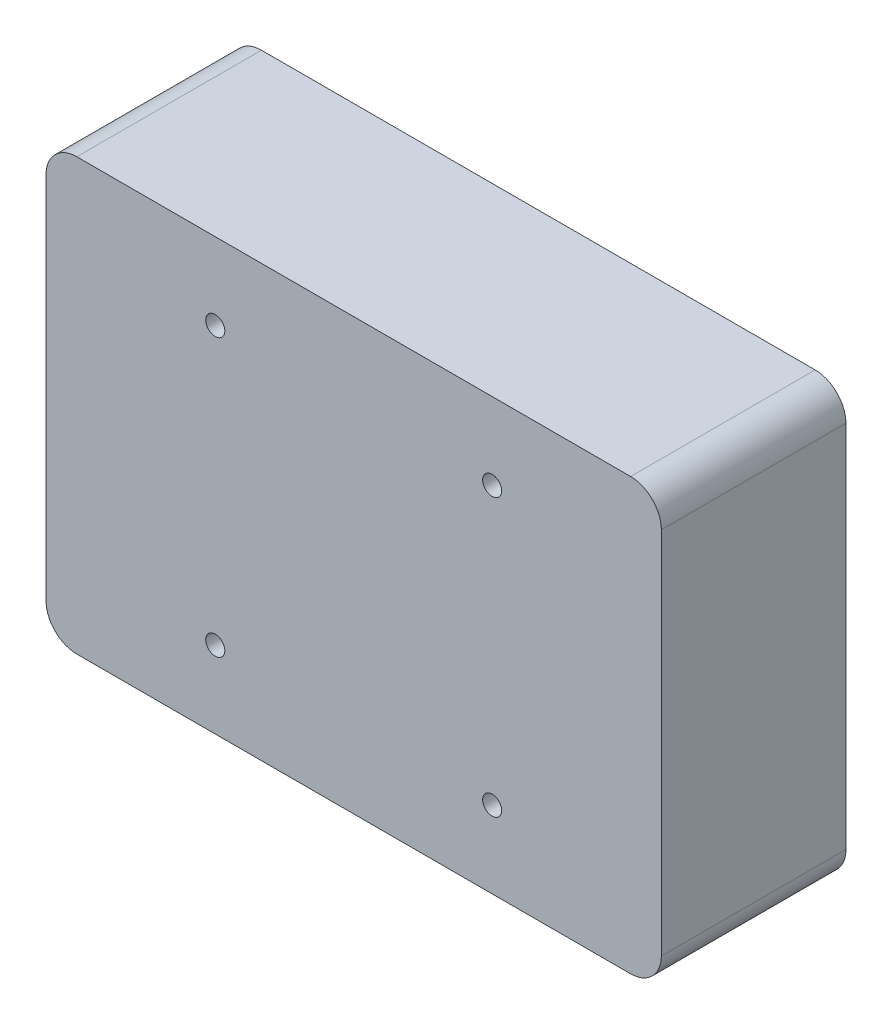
ISO-10303-21;
HEADER;
FILE_DESCRIPTION(('STEP AP214'),'2;1');
FILE_NAME('part.step','',(''),(''),'','','');
FILE_SCHEMA(('AUTOMOTIVE_DESIGN { 1 0 10303 214 1 1 1 1 }'));
ENDSEC;
DATA;
#1=APPLICATION_CONTEXT('core data for automotive mechanical design processes');
#2=APPLICATION_PROTOCOL_DEFINITION('international standard','automotive_design',2000,#1);
#3=PRODUCT_CONTEXT('',#1,'mechanical');
#4=PRODUCT('Part','Part','',(#3));
#5=PRODUCT_RELATED_PRODUCT_CATEGORY('part','',(#4));
#6=PRODUCT_DEFINITION_FORMATION('','',#4);
#7=PRODUCT_DEFINITION_CONTEXT('part definition',#1,'design');
#8=PRODUCT_DEFINITION('design','',#6,#7);
#9=PRODUCT_DEFINITION_SHAPE('','',#8);
#10=(LENGTH_UNIT() NAMED_UNIT(*) SI_UNIT(.MILLI.,.METRE.));
#11=(NAMED_UNIT(*) PLANE_ANGLE_UNIT() SI_UNIT($,.RADIAN.));
#12=(NAMED_UNIT(*) SI_UNIT($,.STERADIAN.) SOLID_ANGLE_UNIT());
#13=UNCERTAINTY_MEASURE_WITH_UNIT(LENGTH_MEASURE(1.E-05),#10,'distance_accuracy_value','');
#14=(GEOMETRIC_REPRESENTATION_CONTEXT(3) GLOBAL_UNCERTAINTY_ASSIGNED_CONTEXT((#13)) GLOBAL_UNIT_ASSIGNED_CONTEXT((#10,
#11,#12)) REPRESENTATION_CONTEXT('',''));
#15=CARTESIAN_POINT('',(0.,0.,0.));
#16=DIRECTION('',(0.,0.,1.));
#17=DIRECTION('',(1.,0.,0.));
#18=AXIS2_PLACEMENT_3D('',#15,#16,#17);
#19=CARTESIAN_POINT('',(0.,0.,30.));
#20=DIRECTION('',(0.,0.,1.));
#21=DIRECTION('',(1.,0.,0.));
#22=AXIS2_PLACEMENT_3D('',#19,#20,#21);
#23=PLANE('',#22);
#24=CARTESIAN_POINT('',(22.5,-22.5,30.));
#25=DIRECTION('',(0.,0.,1.));
#26=DIRECTION('',(1.,0.,0.));
#27=AXIS2_PLACEMENT_3D('',#24,#25,#26);
#28=CIRCLE('',#27,1.55);
#29=CARTESIAN_POINT('',(24.05,-22.5,30.));
#30=VERTEX_POINT('',#29);
#31=EDGE_CURVE('E219',#30,#30,#28,.T.);
#32=ORIENTED_EDGE('',*,*,#31,.F.);
#33=EDGE_LOOP('',(#32));
#34=FACE_BOUND('',#33,.T.);
#35=CARTESIAN_POINT('',(-22.5,22.5,30.));
#36=DIRECTION('',(0.,0.,1.));
#37=DIRECTION('',(1.,0.,0.));
#38=AXIS2_PLACEMENT_3D('',#35,#36,#37);
#39=CIRCLE('',#38,1.55);
#40=CARTESIAN_POINT('',(-20.95,22.5,30.));
#41=VERTEX_POINT('',#40);
#42=EDGE_CURVE('E144',#41,#41,#39,.T.);
#43=ORIENTED_EDGE('',*,*,#42,.F.);
#44=EDGE_LOOP('',(#43));
#45=FACE_BOUND('',#44,.T.);
#46=DIRECTION('',(0.,1.,0.));
#47=VECTOR('',#46,1.);
#48=CARTESIAN_POINT('',(50.,35.,30.));
#49=LINE('',#48,#47);
#50=CARTESIAN_POINT('',(50.,-30.,30.));
#51=VERTEX_POINT('',#50);
#52=CARTESIAN_POINT('',(50.,30.,30.));
#53=VERTEX_POINT('',#52);
#54=EDGE_CURVE('E150',#51,#53,#49,.T.);
#55=ORIENTED_EDGE('',*,*,#54,.T.);
#56=CARTESIAN_POINT('',(45.,30.,30.));
#57=DIRECTION('',(0.,0.,1.));
#58=DIRECTION('',(1.,0.,0.));
#59=AXIS2_PLACEMENT_3D('',#56,#57,#58);
#60=CIRCLE('',#59,5.);
#61=CARTESIAN_POINT('',(45.,35.,30.));
#62=VERTEX_POINT('',#61);
#63=EDGE_CURVE('E174',#53,#62,#60,.T.);
#64=ORIENTED_EDGE('',*,*,#63,.T.);
#65=DIRECTION('',(-1.,0.,0.));
#66=VECTOR('',#65,1.);
#67=CARTESIAN_POINT('',(-50.,35.,30.));
#68=LINE('',#67,#66);
#69=CARTESIAN_POINT('',(-45.,35.,30.));
#70=VERTEX_POINT('',#69);
#71=EDGE_CURVE('E127',#62,#70,#68,.T.);
#72=ORIENTED_EDGE('',*,*,#71,.T.);
#73=CARTESIAN_POINT('',(-45.,30.,30.));
#74=DIRECTION('',(0.,0.,1.));
#75=DIRECTION('',(1.,0.,0.));
#76=AXIS2_PLACEMENT_3D('',#73,#74,#75);
#77=CIRCLE('',#76,5.);
#78=CARTESIAN_POINT('',(-50.,30.,30.));
#79=VERTEX_POINT('',#78);
#80=EDGE_CURVE('E166',#70,#79,#77,.T.);
#81=ORIENTED_EDGE('',*,*,#80,.T.);
#82=DIRECTION('',(0.,-1.,0.));
#83=VECTOR('',#82,1.);
#84=CARTESIAN_POINT('',(-50.,35.,30.));
#85=LINE('',#84,#83);
#86=CARTESIAN_POINT('',(-50.,-30.,30.));
#87=VERTEX_POINT('',#86);
#88=EDGE_CURVE('E189',#79,#87,#85,.T.);
#89=ORIENTED_EDGE('',*,*,#88,.T.);
#90=CARTESIAN_POINT('',(-45.,-30.,30.));
#91=DIRECTION('',(0.,0.,1.));
#92=DIRECTION('',(1.,0.,0.));
#93=AXIS2_PLACEMENT_3D('',#90,#91,#92);
#94=CIRCLE('',#93,5.);
#95=CARTESIAN_POINT('',(-45.,-35.,30.));
#96=VERTEX_POINT('',#95);
#97=EDGE_CURVE('E62',#87,#96,#94,.T.);
#98=ORIENTED_EDGE('',*,*,#97,.T.);
#99=DIRECTION('',(1.,0.,0.));
#100=VECTOR('',#99,1.);
#101=CARTESIAN_POINT('',(-50.,-35.,30.));
#102=LINE('',#101,#100);
#103=CARTESIAN_POINT('',(45.,-35.,30.));
#104=VERTEX_POINT('',#103);
#105=EDGE_CURVE('E152',#96,#104,#102,.T.);
#106=ORIENTED_EDGE('',*,*,#105,.T.);
#107=CARTESIAN_POINT('',(45.,-30.,30.));
#108=DIRECTION('',(0.,0.,1.));
#109=DIRECTION('',(1.,0.,0.));
#110=AXIS2_PLACEMENT_3D('',#107,#108,#109);
#111=CIRCLE('',#110,5.);
#112=EDGE_CURVE('E171',#104,#51,#111,.T.);
#113=ORIENTED_EDGE('',*,*,#112,.T.);
#114=EDGE_LOOP('',(#55,#64,#72,#81,#89,#98,#106,#113));
#115=FACE_BOUND('',#114,.T.);
#116=CARTESIAN_POINT('',(-22.5,-22.5,30.));
#117=DIRECTION('',(0.,0.,1.));
#118=DIRECTION('',(1.,0.,0.));
#119=AXIS2_PLACEMENT_3D('',#116,#117,#118);
#120=CIRCLE('',#119,1.55);
#121=CARTESIAN_POINT('',(-20.95,-22.5,30.));
#122=VERTEX_POINT('',#121);
#123=EDGE_CURVE('E211',#122,#122,#120,.T.);
#124=ORIENTED_EDGE('',*,*,#123,.F.);
#125=EDGE_LOOP('',(#124));
#126=FACE_BOUND('',#125,.T.);
#127=CARTESIAN_POINT('',(22.5,22.5,30.));
#128=DIRECTION('',(0.,0.,1.));
#129=DIRECTION('',(1.,0.,0.));
#130=AXIS2_PLACEMENT_3D('',#127,#128,#129);
#131=CIRCLE('',#130,1.55);
#132=CARTESIAN_POINT('',(24.05,22.5,30.));
#133=VERTEX_POINT('',#132);
#134=EDGE_CURVE('E227',#133,#133,#131,.T.);
#135=ORIENTED_EDGE('',*,*,#134,.F.);
#136=EDGE_LOOP('',(#135));
#137=FACE_BOUND('',#136,.T.);
#138=ADVANCED_FACE('F39',(#34,#45,#115,#126,#137),#23,.T.);
#139=CARTESIAN_POINT('',(0.,0.,0.));
#140=DIRECTION('',(0.,0.,1.));
#141=DIRECTION('',(1.,0.,0.));
#142=AXIS2_PLACEMENT_3D('',#139,#140,#141);
#143=PLANE('',#142);
#144=DIRECTION('',(-1.,0.,0.));
#145=VECTOR('',#144,1.);
#146=CARTESIAN_POINT('',(-50.,35.,0.));
#147=LINE('',#146,#145);
#148=CARTESIAN_POINT('',(45.,35.,0.));
#149=VERTEX_POINT('',#148);
#150=CARTESIAN_POINT('',(-45.,35.,0.));
#151=VERTEX_POINT('',#150);
#152=EDGE_CURVE('E124',#149,#151,#147,.T.);
#153=ORIENTED_EDGE('',*,*,#152,.F.);
#154=CARTESIAN_POINT('',(45.,30.,0.));
#155=DIRECTION('',(0.,0.,1.));
#156=DIRECTION('',(1.,0.,0.));
#157=AXIS2_PLACEMENT_3D('',#154,#155,#156);
#158=CIRCLE('',#157,5.);
#159=CARTESIAN_POINT('',(50.,30.,0.));
#160=VERTEX_POINT('',#159);
#161=EDGE_CURVE('E106',#149,#160,#158,.F.);
#162=ORIENTED_EDGE('',*,*,#161,.T.);
#163=DIRECTION('',(0.,1.,0.));
#164=VECTOR('',#163,1.);
#165=CARTESIAN_POINT('',(50.,35.,0.));
#166=LINE('',#165,#164);
#167=CARTESIAN_POINT('',(50.,-30.,0.));
#168=VERTEX_POINT('',#167);
#169=EDGE_CURVE('E137',#168,#160,#166,.T.);
#170=ORIENTED_EDGE('',*,*,#169,.F.);
#171=CARTESIAN_POINT('',(45.,-30.,0.));
#172=DIRECTION('',(0.,0.,1.));
#173=DIRECTION('',(1.,0.,0.));
#174=AXIS2_PLACEMENT_3D('',#171,#172,#173);
#175=CIRCLE('',#174,5.);
#176=CARTESIAN_POINT('',(45.,-35.,0.));
#177=VERTEX_POINT('',#176);
#178=EDGE_CURVE('E118',#168,#177,#175,.F.);
#179=ORIENTED_EDGE('',*,*,#178,.T.);
#180=DIRECTION('',(1.,0.,0.));
#181=VECTOR('',#180,1.);
#182=CARTESIAN_POINT('',(-50.,-35.,0.));
#183=LINE('',#182,#181);
#184=CARTESIAN_POINT('',(-45.,-35.,0.));
#185=VERTEX_POINT('',#184);
#186=EDGE_CURVE('E142',#185,#177,#183,.T.);
#187=ORIENTED_EDGE('',*,*,#186,.F.);
#188=CARTESIAN_POINT('',(-45.,-30.,0.));
#189=DIRECTION('',(0.,0.,1.));
#190=DIRECTION('',(1.,0.,0.));
#191=AXIS2_PLACEMENT_3D('',#188,#189,#190);
#192=CIRCLE('',#191,5.);
#193=CARTESIAN_POINT('',(-50.,-30.,0.));
#194=VERTEX_POINT('',#193);
#195=EDGE_CURVE('E156',#185,#194,#192,.F.);
#196=ORIENTED_EDGE('',*,*,#195,.T.);
#197=DIRECTION('',(0.,-1.,0.));
#198=VECTOR('',#197,1.);
#199=CARTESIAN_POINT('',(-50.,35.,0.));
#200=LINE('',#199,#198);
#201=CARTESIAN_POINT('',(-50.,30.,0.));
#202=VERTEX_POINT('',#201);
#203=EDGE_CURVE('E136',#202,#194,#200,.T.);
#204=ORIENTED_EDGE('',*,*,#203,.F.);
#205=CARTESIAN_POINT('',(-45.,30.,0.));
#206=DIRECTION('',(0.,0.,1.));
#207=DIRECTION('',(1.,0.,0.));
#208=AXIS2_PLACEMENT_3D('',#205,#206,#207);
#209=CIRCLE('',#208,5.);
#210=EDGE_CURVE('E129',#202,#151,#209,.F.);
#211=ORIENTED_EDGE('',*,*,#210,.T.);
#212=EDGE_LOOP('',(#153,#162,#170,#179,#187,#196,#204,#211));
#213=FACE_BOUND('',#212,.T.);
#214=CARTESIAN_POINT('',(-22.5,22.5,0.));
#215=DIRECTION('',(0.,0.,1.));
#216=DIRECTION('',(1.,0.,0.));
#217=AXIS2_PLACEMENT_3D('',#214,#215,#216);
#218=CIRCLE('',#217,1.55);
#219=CARTESIAN_POINT('',(-20.95,22.5,0.));
#220=VERTEX_POINT('',#219);
#221=EDGE_CURVE('E207',#220,#220,#218,.T.);
#222=ORIENTED_EDGE('',*,*,#221,.T.);
#223=EDGE_LOOP('',(#222));
#224=FACE_BOUND('',#223,.T.);
#225=CARTESIAN_POINT('',(-22.5,-22.5,0.));
#226=DIRECTION('',(0.,0.,1.));
#227=DIRECTION('',(1.,0.,0.));
#228=AXIS2_PLACEMENT_3D('',#225,#226,#227);
#229=CIRCLE('',#228,1.55);
#230=CARTESIAN_POINT('',(-20.95,-22.5,0.));
#231=VERTEX_POINT('',#230);
#232=EDGE_CURVE('E215',#231,#231,#229,.T.);
#233=ORIENTED_EDGE('',*,*,#232,.T.);
#234=EDGE_LOOP('',(#233));
#235=FACE_BOUND('',#234,.T.);
#236=CARTESIAN_POINT('',(22.5,-22.5,0.));
#237=DIRECTION('',(0.,0.,1.));
#238=DIRECTION('',(1.,0.,0.));
#239=AXIS2_PLACEMENT_3D('',#236,#237,#238);
#240=CIRCLE('',#239,1.55);
#241=CARTESIAN_POINT('',(24.05,-22.5,0.));
#242=VERTEX_POINT('',#241);
#243=EDGE_CURVE('E223',#242,#242,#240,.T.);
#244=ORIENTED_EDGE('',*,*,#243,.T.);
#245=EDGE_LOOP('',(#244));
#246=FACE_BOUND('',#245,.T.);
#247=CARTESIAN_POINT('',(22.5,22.5,0.));
#248=DIRECTION('',(0.,0.,1.));
#249=DIRECTION('',(1.,0.,0.));
#250=AXIS2_PLACEMENT_3D('',#247,#248,#249);
#251=CIRCLE('',#250,1.55);
#252=CARTESIAN_POINT('',(24.05,22.5,0.));
#253=VERTEX_POINT('',#252);
#254=EDGE_CURVE('E231',#253,#253,#251,.T.);
#255=ORIENTED_EDGE('',*,*,#254,.T.);
#256=EDGE_LOOP('',(#255));
#257=FACE_BOUND('',#256,.T.);
#258=ADVANCED_FACE('F132',(#213,#224,#235,#246,#257),#143,.F.);
#259=CARTESIAN_POINT('',(50.,35.,30.));
#260=DIRECTION('',(-1.,0.,0.));
#261=DIRECTION('',(0.,-1.,0.));
#262=AXIS2_PLACEMENT_3D('',#259,#260,#261);
#263=PLANE('',#262);
#264=ORIENTED_EDGE('',*,*,#169,.T.);
#265=DIRECTION('',(0.,0.,-1.));
#266=VECTOR('',#265,1.);
#267=CARTESIAN_POINT('',(50.,30.,30.));
#268=LINE('',#267,#266);
#269=EDGE_CURVE('E111',#160,#53,#268,.F.);
#270=ORIENTED_EDGE('',*,*,#269,.T.);
#271=ORIENTED_EDGE('',*,*,#54,.F.);
#272=DIRECTION('',(0.,0.,-1.));
#273=VECTOR('',#272,1.);
#274=CARTESIAN_POINT('',(50.,-30.,30.));
#275=LINE('',#274,#273);
#276=EDGE_CURVE('E117',#51,#168,#275,.T.);
#277=ORIENTED_EDGE('',*,*,#276,.T.);
#278=EDGE_LOOP('',(#264,#270,#271,#277));
#279=FACE_BOUND('',#278,.T.);
#280=ADVANCED_FACE('F248',(#279),#263,.F.);
#281=CARTESIAN_POINT('',(-50.,35.,30.));
#282=DIRECTION('',(0.,-1.,0.));
#283=DIRECTION('',(0.,0.,-1.));
#284=AXIS2_PLACEMENT_3D('',#281,#282,#283);
#285=PLANE('',#284);
#286=ORIENTED_EDGE('',*,*,#71,.F.);
#287=DIRECTION('',(0.,0.,-1.));
#288=VECTOR('',#287,1.);
#289=CARTESIAN_POINT('',(45.,35.,30.));
#290=LINE('',#289,#288);
#291=EDGE_CURVE('E110',#62,#149,#290,.T.);
#292=ORIENTED_EDGE('',*,*,#291,.T.);
#293=ORIENTED_EDGE('',*,*,#152,.T.);
#294=DIRECTION('',(0.,0.,-1.));
#295=VECTOR('',#294,1.);
#296=CARTESIAN_POINT('',(-45.,35.,30.));
#297=LINE('',#296,#295);
#298=EDGE_CURVE('E130',#151,#70,#297,.F.);
#299=ORIENTED_EDGE('',*,*,#298,.T.);
#300=EDGE_LOOP('',(#286,#292,#293,#299));
#301=FACE_BOUND('',#300,.T.);
#302=ADVANCED_FACE('F123',(#301),#285,.F.);
#303=CARTESIAN_POINT('',(-50.,35.,30.));
#304=DIRECTION('',(1.,0.,0.));
#305=DIRECTION('',(0.,1.,0.));
#306=AXIS2_PLACEMENT_3D('',#303,#304,#305);
#307=PLANE('',#306);
#308=ORIENTED_EDGE('',*,*,#203,.T.);
#309=DIRECTION('',(0.,0.,-1.));
#310=VECTOR('',#309,1.);
#311=CARTESIAN_POINT('',(-50.,-30.,30.));
#312=LINE('',#311,#310);
#313=EDGE_CURVE('E11',#194,#87,#312,.F.);
#314=ORIENTED_EDGE('',*,*,#313,.T.);
#315=ORIENTED_EDGE('',*,*,#88,.F.);
#316=DIRECTION('',(0.,0.,-1.));
#317=VECTOR('',#316,1.);
#318=CARTESIAN_POINT('',(-50.,30.,30.));
#319=LINE('',#318,#317);
#320=EDGE_CURVE('E48',#79,#202,#319,.T.);
#321=ORIENTED_EDGE('',*,*,#320,.T.);
#322=EDGE_LOOP('',(#308,#314,#315,#321));
#323=FACE_BOUND('',#322,.T.);
#324=ADVANCED_FACE('F187',(#323),#307,.F.);
#325=CARTESIAN_POINT('',(-50.,-35.,30.));
#326=DIRECTION('',(0.,1.,0.));
#327=DIRECTION('',(0.,0.,1.));
#328=AXIS2_PLACEMENT_3D('',#325,#326,#327);
#329=PLANE('',#328);
#330=ORIENTED_EDGE('',*,*,#186,.T.);
#331=DIRECTION('',(0.,0.,-1.));
#332=VECTOR('',#331,1.);
#333=CARTESIAN_POINT('',(45.,-35.,30.));
#334=LINE('',#333,#332);
#335=EDGE_CURVE('E55',#177,#104,#334,.F.);
#336=ORIENTED_EDGE('',*,*,#335,.T.);
#337=ORIENTED_EDGE('',*,*,#105,.F.);
#338=DIRECTION('',(0.,0.,-1.));
#339=VECTOR('',#338,1.);
#340=CARTESIAN_POINT('',(-45.,-35.,30.));
#341=LINE('',#340,#339);
#342=EDGE_CURVE('E177',#96,#185,#341,.T.);
#343=ORIENTED_EDGE('',*,*,#342,.T.);
#344=EDGE_LOOP('',(#330,#336,#337,#343));
#345=FACE_BOUND('',#344,.T.);
#346=ADVANCED_FACE('F196',(#345),#329,.F.);
#347=CARTESIAN_POINT('',(-22.5,22.5,30.));
#348=DIRECTION('',(0.,0.,-1.));
#349=DIRECTION('',(-1.,0.,0.));
#350=AXIS2_PLACEMENT_3D('',#347,#348,#349);
#351=CYLINDRICAL_SURFACE('',#350,1.55);
#352=ORIENTED_EDGE('',*,*,#42,.T.);
#353=EDGE_LOOP('',(#352));
#354=FACE_BOUND('',#353,.T.);
#355=ORIENTED_EDGE('',*,*,#221,.F.);
#356=EDGE_LOOP('',(#355));
#357=FACE_BOUND('',#356,.T.);
#358=ADVANCED_FACE('F253',(#354,#357),#351,.F.);
#359=CARTESIAN_POINT('',(-22.5,-22.5,30.));
#360=DIRECTION('',(0.,0.,-1.));
#361=DIRECTION('',(-1.,0.,0.));
#362=AXIS2_PLACEMENT_3D('',#359,#360,#361);
#363=CYLINDRICAL_SURFACE('',#362,1.55);
#364=ORIENTED_EDGE('',*,*,#123,.T.);
#365=EDGE_LOOP('',(#364));
#366=FACE_BOUND('',#365,.T.);
#367=ORIENTED_EDGE('',*,*,#232,.F.);
#368=EDGE_LOOP('',(#367));
#369=FACE_BOUND('',#368,.T.);
#370=ADVANCED_FACE('F281',(#366,#369),#363,.F.);
#371=CARTESIAN_POINT('',(22.5,-22.5,30.));
#372=DIRECTION('',(0.,0.,-1.));
#373=DIRECTION('',(-1.,0.,0.));
#374=AXIS2_PLACEMENT_3D('',#371,#372,#373);
#375=CYLINDRICAL_SURFACE('',#374,1.55);
#376=ORIENTED_EDGE('',*,*,#31,.T.);
#377=EDGE_LOOP('',(#376));
#378=FACE_BOUND('',#377,.T.);
#379=ORIENTED_EDGE('',*,*,#243,.F.);
#380=EDGE_LOOP('',(#379));
#381=FACE_BOUND('',#380,.T.);
#382=ADVANCED_FACE('F284',(#378,#381),#375,.F.);
#383=CARTESIAN_POINT('',(22.5,22.5,30.));
#384=DIRECTION('',(0.,0.,-1.));
#385=DIRECTION('',(-1.,0.,0.));
#386=AXIS2_PLACEMENT_3D('',#383,#384,#385);
#387=CYLINDRICAL_SURFACE('',#386,1.55);
#388=ORIENTED_EDGE('',*,*,#134,.T.);
#389=EDGE_LOOP('',(#388));
#390=FACE_BOUND('',#389,.T.);
#391=ORIENTED_EDGE('',*,*,#254,.F.);
#392=EDGE_LOOP('',(#391));
#393=FACE_BOUND('',#392,.T.);
#394=ADVANCED_FACE('F239',(#390,#393),#387,.F.);
#395=CARTESIAN_POINT('',(45.,30.,30.));
#396=DIRECTION('',(0.,0.,-1.));
#397=DIRECTION('',(-1.,0.,0.));
#398=AXIS2_PLACEMENT_3D('',#395,#396,#397);
#399=CYLINDRICAL_SURFACE('',#398,5.);
#400=ORIENTED_EDGE('',*,*,#63,.F.);
#401=ORIENTED_EDGE('',*,*,#269,.F.);
#402=ORIENTED_EDGE('',*,*,#161,.F.);
#403=ORIENTED_EDGE('',*,*,#291,.F.);
#404=EDGE_LOOP('',(#400,#401,#402,#403));
#405=FACE_BOUND('',#404,.T.);
#406=ADVANCED_FACE('F109',(#405),#399,.T.);
#407=CARTESIAN_POINT('',(45.,-30.,30.));
#408=DIRECTION('',(0.,0.,-1.));
#409=DIRECTION('',(-1.,0.,0.));
#410=AXIS2_PLACEMENT_3D('',#407,#408,#409);
#411=CYLINDRICAL_SURFACE('',#410,5.);
#412=ORIENTED_EDGE('',*,*,#112,.F.);
#413=ORIENTED_EDGE('',*,*,#335,.F.);
#414=ORIENTED_EDGE('',*,*,#178,.F.);
#415=ORIENTED_EDGE('',*,*,#276,.F.);
#416=EDGE_LOOP('',(#412,#413,#414,#415));
#417=FACE_BOUND('',#416,.T.);
#418=ADVANCED_FACE('F267',(#417),#411,.T.);
#419=CARTESIAN_POINT('',(-45.,-30.,30.));
#420=DIRECTION('',(0.,0.,-1.));
#421=DIRECTION('',(-1.,0.,0.));
#422=AXIS2_PLACEMENT_3D('',#419,#420,#421);
#423=CYLINDRICAL_SURFACE('',#422,5.);
#424=ORIENTED_EDGE('',*,*,#97,.F.);
#425=ORIENTED_EDGE('',*,*,#313,.F.);
#426=ORIENTED_EDGE('',*,*,#195,.F.);
#427=ORIENTED_EDGE('',*,*,#342,.F.);
#428=EDGE_LOOP('',(#424,#425,#426,#427));
#429=FACE_BOUND('',#428,.T.);
#430=ADVANCED_FACE('F195',(#429),#423,.T.);
#431=CARTESIAN_POINT('',(-45.,30.,30.));
#432=DIRECTION('',(0.,0.,-1.));
#433=DIRECTION('',(-1.,0.,0.));
#434=AXIS2_PLACEMENT_3D('',#431,#432,#433);
#435=CYLINDRICAL_SURFACE('',#434,5.);
#436=ORIENTED_EDGE('',*,*,#80,.F.);
#437=ORIENTED_EDGE('',*,*,#298,.F.);
#438=ORIENTED_EDGE('',*,*,#210,.F.);
#439=ORIENTED_EDGE('',*,*,#320,.F.);
#440=EDGE_LOOP('',(#436,#437,#438,#439));
#441=FACE_BOUND('',#440,.T.);
#442=ADVANCED_FACE('F41',(#441),#435,.T.);
#443=CLOSED_SHELL('',(#138,#258,#280,#302,#324,#346,#358,#370,#382,#394,#406,#418,#430,#442));
#444=MANIFOLD_SOLID_BREP('B2',#443);
#445=ADVANCED_BREP_SHAPE_REPRESENTATION('',(#18,#444),#14);
#446=SHAPE_DEFINITION_REPRESENTATION(#9,#445);
ENDSEC;
END-ISO-10303-21;
